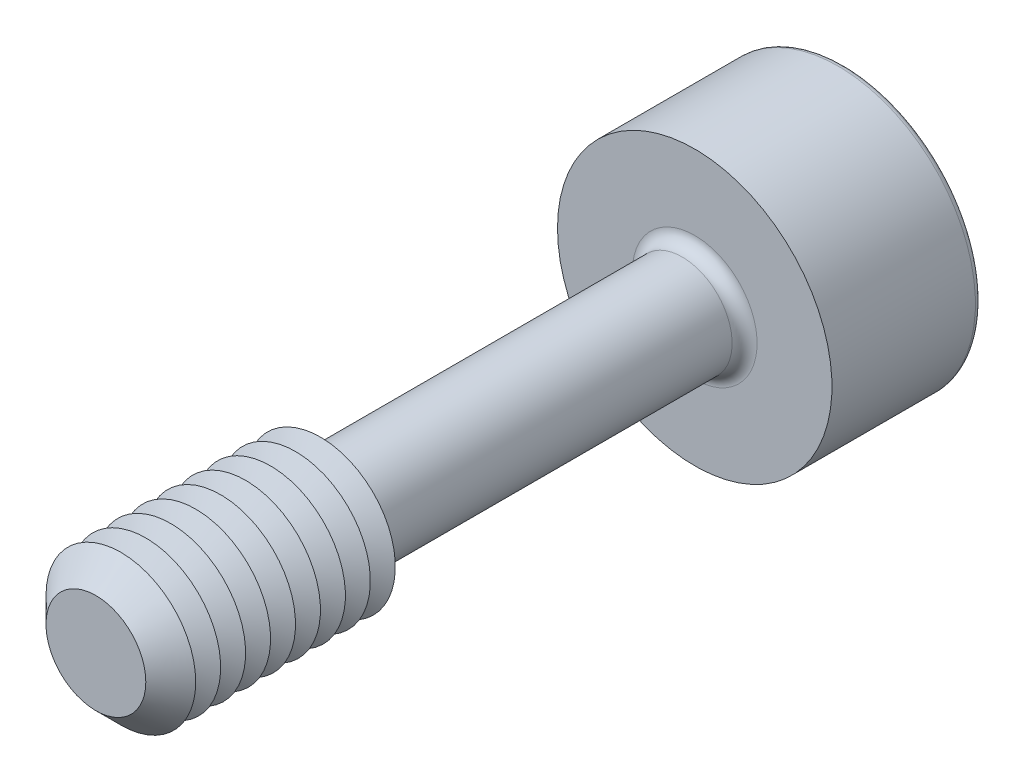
ISO-10303-21;
HEADER;
FILE_DESCRIPTION(('STEP AP214'),'2;1');
FILE_NAME('part.step','',(''),(''),'','','');
FILE_SCHEMA(('AUTOMOTIVE_DESIGN { 1 0 10303 214 1 1 1 1 }'));
ENDSEC;
DATA;
#1=APPLICATION_CONTEXT('core data for automotive mechanical design processes');
#2=APPLICATION_PROTOCOL_DEFINITION('international standard','automotive_design',2000,#1);
#3=PRODUCT_CONTEXT('',#1,'mechanical');
#4=PRODUCT('Part','Part','',(#3));
#5=PRODUCT_RELATED_PRODUCT_CATEGORY('part','',(#4));
#6=PRODUCT_DEFINITION_FORMATION('','',#4);
#7=PRODUCT_DEFINITION_CONTEXT('part definition',#1,'design');
#8=PRODUCT_DEFINITION('design','',#6,#7);
#9=PRODUCT_DEFINITION_SHAPE('','',#8);
#10=(LENGTH_UNIT() NAMED_UNIT(*) SI_UNIT(.MILLI.,.METRE.));
#11=(NAMED_UNIT(*) PLANE_ANGLE_UNIT() SI_UNIT($,.RADIAN.));
#12=(NAMED_UNIT(*) SI_UNIT($,.STERADIAN.) SOLID_ANGLE_UNIT());
#13=UNCERTAINTY_MEASURE_WITH_UNIT(LENGTH_MEASURE(1.E-05),#10,'distance_accuracy_value','');
#14=(GEOMETRIC_REPRESENTATION_CONTEXT(3) GLOBAL_UNCERTAINTY_ASSIGNED_CONTEXT((#13)) GLOBAL_UNIT_ASSIGNED_CONTEXT((#10,
#11,#12)) REPRESENTATION_CONTEXT('',''));
#15=CARTESIAN_POINT('',(0.,0.,0.));
#16=DIRECTION('',(0.,0.,1.));
#17=DIRECTION('',(1.,0.,0.));
#18=AXIS2_PLACEMENT_3D('',#15,#16,#17);
#19=CARTESIAN_POINT('',(-0.721687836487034,-1.25,-6.5));
#20=DIRECTION('',(0.,0.,1.));
#21=DIRECTION('',(1.,0.,0.));
#22=AXIS2_PLACEMENT_3D('',#19,#20,#21);
#23=PLANE('',#22);
#24=DIRECTION('',(1.,0.,0.));
#25=VECTOR('',#24,1.);
#26=CARTESIAN_POINT('',(-0.721687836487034,-1.25,-6.5));
#27=LINE('',#26,#25);
#28=CARTESIAN_POINT('',(0.,-1.25,-6.5));
#29=VERTEX_POINT('',#28);
#30=CARTESIAN_POINT('',(0.721687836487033,-1.25,-6.5));
#31=VERTEX_POINT('',#30);
#32=EDGE_CURVE('E413',#29,#31,#27,.T.);
#33=ORIENTED_EDGE('',*,*,#32,.F.);
#34=CARTESIAN_POINT('',(0.,0.,-6.5));
#35=DIRECTION('',(0.,0.,1.));
#36=DIRECTION('',(0.,-1.,0.));
#37=AXIS2_PLACEMENT_3D('',#34,#35,#36);
#38=CIRCLE('',#37,1.25);
#39=CARTESIAN_POINT('',(1.08253175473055,-0.624999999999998,-6.5));
#40=VERTEX_POINT('',#39);
#41=EDGE_CURVE('E53',#29,#40,#38,.T.);
#42=ORIENTED_EDGE('',*,*,#41,.T.);
#43=DIRECTION('',(0.499999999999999,0.866025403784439,0.));
#44=VECTOR('',#43,1.);
#45=CARTESIAN_POINT('',(0.721687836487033,-1.25,-6.5));
#46=LINE('',#45,#44);
#47=EDGE_CURVE('E403',#31,#40,#46,.T.);
#48=ORIENTED_EDGE('',*,*,#47,.F.);
#49=EDGE_LOOP('',(#33,#42,#48));
#50=FACE_BOUND('',#49,.T.);
#51=ADVANCED_FACE('F41',(#50),#23,.F.);
#52=CARTESIAN_POINT('',(1.44337567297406,0.,-6.5));
#53=VERTEX_POINT('',#52);
#54=EDGE_CURVE('E407',#40,#53,#46,.T.);
#55=ORIENTED_EDGE('',*,*,#54,.F.);
#56=CARTESIAN_POINT('',(1.08253175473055,0.625000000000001,-6.5));
#57=VERTEX_POINT('',#56);
#58=EDGE_CURVE('E11',#40,#57,#38,.T.);
#59=ORIENTED_EDGE('',*,*,#58,.T.);
#60=DIRECTION('',(-0.499999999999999,0.866025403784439,0.));
#61=VECTOR('',#60,1.);
#62=CARTESIAN_POINT('',(1.44337567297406,0.,-6.5));
#63=LINE('',#62,#61);
#64=EDGE_CURVE('E399',#53,#57,#63,.T.);
#65=ORIENTED_EDGE('',*,*,#64,.F.);
#66=EDGE_LOOP('',(#55,#59,#65));
#67=FACE_BOUND('',#66,.T.);
#68=ADVANCED_FACE('F133',(#67),#23,.F.);
#69=CARTESIAN_POINT('',(0.721687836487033,1.25,-6.5));
#70=VERTEX_POINT('',#69);
#71=EDGE_CURVE('E398',#57,#70,#63,.T.);
#72=ORIENTED_EDGE('',*,*,#71,.F.);
#73=CARTESIAN_POINT('',(0.,1.25,-6.5));
#74=VERTEX_POINT('',#73);
#75=EDGE_CURVE('E51',#57,#74,#38,.T.);
#76=ORIENTED_EDGE('',*,*,#75,.T.);
#77=DIRECTION('',(-1.,0.,0.));
#78=VECTOR('',#77,1.);
#79=CARTESIAN_POINT('',(0.721687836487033,1.25,-6.5));
#80=LINE('',#79,#78);
#81=EDGE_CURVE('E177',#70,#74,#80,.T.);
#82=ORIENTED_EDGE('',*,*,#81,.F.);
#83=EDGE_LOOP('',(#72,#76,#82));
#84=FACE_BOUND('',#83,.T.);
#85=ADVANCED_FACE('F139',(#84),#23,.F.);
#86=CARTESIAN_POINT('',(-0.721687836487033,1.25,-6.5));
#87=VERTEX_POINT('',#86);
#88=EDGE_CURVE('E405',#74,#87,#80,.T.);
#89=ORIENTED_EDGE('',*,*,#88,.F.);
#90=CARTESIAN_POINT('',(-1.08253175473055,0.625000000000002,-6.5));
#91=VERTEX_POINT('',#90);
#92=EDGE_CURVE('E264',#74,#91,#38,.T.);
#93=ORIENTED_EDGE('',*,*,#92,.T.);
#94=DIRECTION('',(-0.5,-0.866025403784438,0.));
#95=VECTOR('',#94,1.);
#96=CARTESIAN_POINT('',(-0.721687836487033,1.25,-6.5));
#97=LINE('',#96,#95);
#98=EDGE_CURVE('E176',#87,#91,#97,.T.);
#99=ORIENTED_EDGE('',*,*,#98,.F.);
#100=EDGE_LOOP('',(#89,#93,#99));
#101=FACE_BOUND('',#100,.T.);
#102=ADVANCED_FACE('F157',(#101),#23,.F.);
#103=CARTESIAN_POINT('',(-1.44337567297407,0.,-6.5));
#104=VERTEX_POINT('',#103);
#105=EDGE_CURVE('E170',#91,#104,#97,.T.);
#106=ORIENTED_EDGE('',*,*,#105,.F.);
#107=CARTESIAN_POINT('',(-1.08253175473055,-0.624999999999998,-6.5));
#108=VERTEX_POINT('',#107);
#109=EDGE_CURVE('E172',#91,#108,#38,.T.);
#110=ORIENTED_EDGE('',*,*,#109,.T.);
#111=DIRECTION('',(0.5,-0.866025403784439,0.));
#112=VECTOR('',#111,1.);
#113=CARTESIAN_POINT('',(-1.44337567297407,0.,-6.5));
#114=LINE('',#113,#112);
#115=EDGE_CURVE('E174',#104,#108,#114,.T.);
#116=ORIENTED_EDGE('',*,*,#115,.F.);
#117=EDGE_LOOP('',(#106,#110,#116));
#118=FACE_BOUND('',#117,.T.);
#119=ADVANCED_FACE('F146',(#118),#23,.F.);
#120=CARTESIAN_POINT('',(0.,0.,-9.));
#121=DIRECTION('',(0.,0.,-1.));
#122=DIRECTION('',(-1.,0.,0.));
#123=AXIS2_PLACEMENT_3D('',#120,#121,#122);
#124=PLANE('',#123);
#125=CARTESIAN_POINT('',(0.,0.,-9.));
#126=DIRECTION('',(0.,0.,-1.));
#127=DIRECTION('',(-1.,0.,0.));
#128=AXIS2_PLACEMENT_3D('',#125,#126,#127);
#129=CIRCLE('',#128,2.625);
#130=CARTESIAN_POINT('',(-2.625,0.,-9.));
#131=VERTEX_POINT('',#130);
#132=EDGE_CURVE('E250',#131,#131,#129,.T.);
#133=ORIENTED_EDGE('',*,*,#132,.T.);
#134=EDGE_LOOP('',(#133));
#135=FACE_BOUND('',#134,.T.);
#136=DIRECTION('',(-0.5,-0.866025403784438,0.));
#137=VECTOR('',#136,1.);
#138=CARTESIAN_POINT('',(-0.721687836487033,1.25,-9.));
#139=LINE('',#138,#137);
#140=CARTESIAN_POINT('',(-0.721687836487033,1.25,-9.));
#141=VERTEX_POINT('',#140);
#142=CARTESIAN_POINT('',(-1.44337567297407,0.,-9.));
#143=VERTEX_POINT('',#142);
#144=EDGE_CURVE('E212',#141,#143,#139,.T.);
#145=ORIENTED_EDGE('',*,*,#144,.T.);
#146=DIRECTION('',(0.5,-0.866025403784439,0.));
#147=VECTOR('',#146,1.);
#148=CARTESIAN_POINT('',(-1.44337567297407,0.,-9.));
#149=LINE('',#148,#147);
#150=CARTESIAN_POINT('',(-0.721687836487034,-1.25,-9.));
#151=VERTEX_POINT('',#150);
#152=EDGE_CURVE('E67',#143,#151,#149,.T.);
#153=ORIENTED_EDGE('',*,*,#152,.T.);
#154=DIRECTION('',(1.,0.,0.));
#155=VECTOR('',#154,1.);
#156=CARTESIAN_POINT('',(-0.721687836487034,-1.25,-9.));
#157=LINE('',#156,#155);
#158=CARTESIAN_POINT('',(0.721687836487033,-1.25,-9.));
#159=VERTEX_POINT('',#158);
#160=EDGE_CURVE('E196',#151,#159,#157,.T.);
#161=ORIENTED_EDGE('',*,*,#160,.T.);
#162=DIRECTION('',(0.499999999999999,0.866025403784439,0.));
#163=VECTOR('',#162,1.);
#164=CARTESIAN_POINT('',(0.721687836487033,-1.25,-9.));
#165=LINE('',#164,#163);
#166=CARTESIAN_POINT('',(1.44337567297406,0.,-9.));
#167=VERTEX_POINT('',#166);
#168=EDGE_CURVE('E200',#159,#167,#165,.T.);
#169=ORIENTED_EDGE('',*,*,#168,.T.);
#170=DIRECTION('',(-0.499999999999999,0.866025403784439,0.));
#171=VECTOR('',#170,1.);
#172=CARTESIAN_POINT('',(1.44337567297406,0.,-9.));
#173=LINE('',#172,#171);
#174=CARTESIAN_POINT('',(0.721687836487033,1.25,-9.));
#175=VERTEX_POINT('',#174);
#176=EDGE_CURVE('E204',#167,#175,#173,.T.);
#177=ORIENTED_EDGE('',*,*,#176,.T.);
#178=DIRECTION('',(-1.,0.,0.));
#179=VECTOR('',#178,1.);
#180=CARTESIAN_POINT('',(0.721687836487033,1.25,-9.));
#181=LINE('',#180,#179);
#182=EDGE_CURVE('E208',#175,#141,#181,.T.);
#183=ORIENTED_EDGE('',*,*,#182,.T.);
#184=EDGE_LOOP('',(#145,#153,#161,#169,#177,#183));
#185=FACE_BOUND('',#184,.T.);
#186=ADVANCED_FACE('F156',(#135,#185),#124,.T.);
#187=CARTESIAN_POINT('',(0.,0.,6.));
#188=DIRECTION('',(0.,0.,-1.));
#189=DIRECTION('',(-1.,0.,0.));
#190=AXIS2_PLACEMENT_3D('',#187,#188,#189);
#191=CYLINDRICAL_SURFACE('',#190,1.);
#192=CARTESIAN_POINT('',(0.,0.,-5.75));
#193=DIRECTION('',(0.,0.,-1.));
#194=DIRECTION('',(-1.,0.,0.));
#195=AXIS2_PLACEMENT_3D('',#192,#193,#194);
#196=CIRCLE('',#195,1.);
#197=CARTESIAN_POINT('',(-1.,0.,-5.75));
#198=VERTEX_POINT('',#197);
#199=EDGE_CURVE('E247',#198,#198,#196,.F.);
#200=ORIENTED_EDGE('',*,*,#199,.T.);
#201=EDGE_LOOP('',(#200));
#202=FACE_BOUND('',#201,.T.);
#203=CARTESIAN_POINT('',(0.,0.,1.21132486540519));
#204=DIRECTION('',(0.,0.,-1.));
#205=DIRECTION('',(0.,1.,0.));
#206=AXIS2_PLACEMENT_3D('',#203,#204,#205);
#207=CIRCLE('',#206,1.);
#208=CARTESIAN_POINT('',(0.,1.,1.21132486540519));
#209=VERTEX_POINT('',#208);
#210=EDGE_CURVE('E235',#209,#209,#207,.T.);
#211=ORIENTED_EDGE('',*,*,#210,.T.);
#212=EDGE_LOOP('',(#211));
#213=FACE_BOUND('',#212,.T.);
#214=ADVANCED_FACE('F163',(#202,#213),#191,.T.);
#215=CARTESIAN_POINT('',(0.,0.,1.21132486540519));
#216=DIRECTION('',(0.,0.,1.));
#217=DIRECTION('',(0.,-1.,0.));
#218=AXIS2_PLACEMENT_3D('',#215,#216,#217);
#219=CONICAL_SURFACE('',#218,1.,1.0471975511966);
#220=CARTESIAN_POINT('',(0.,0.,1.5));
#221=DIRECTION('',(0.,0.,-1.));
#222=DIRECTION('',(-1.,0.,0.));
#223=AXIS2_PLACEMENT_3D('',#220,#221,#222);
#224=CIRCLE('',#223,1.5);
#225=CARTESIAN_POINT('',(-1.5,0.,1.5));
#226=VERTEX_POINT('',#225);
#227=EDGE_CURVE('E268',#226,#226,#224,.T.);
#228=ORIENTED_EDGE('',*,*,#227,.T.);
#229=EDGE_LOOP('',(#228));
#230=FACE_BOUND('',#229,.T.);
#231=ORIENTED_EDGE('',*,*,#210,.F.);
#232=EDGE_LOOP('',(#231));
#233=FACE_BOUND('',#232,.T.);
#234=ADVANCED_FACE('F356',(#230,#233),#219,.T.);
#235=CARTESIAN_POINT('',(0.,0.,-6.));
#236=DIRECTION('',(0.,0.,-1.));
#237=DIRECTION('',(-1.,0.,0.));
#238=AXIS2_PLACEMENT_3D('',#235,#236,#237);
#239=PLANE('',#238);
#240=CARTESIAN_POINT('',(0.,0.,-6.));
#241=DIRECTION('',(0.,0.,-1.));
#242=DIRECTION('',(-1.,0.,0.));
#243=AXIS2_PLACEMENT_3D('',#240,#241,#242);
#244=CIRCLE('',#243,1.25);
#245=CARTESIAN_POINT('',(-1.25,0.,-6.));
#246=VERTEX_POINT('',#245);
#247=EDGE_CURVE('E243',#246,#246,#244,.T.);
#248=ORIENTED_EDGE('',*,*,#247,.T.);
#249=EDGE_LOOP('',(#248));
#250=FACE_BOUND('',#249,.T.);
#251=CARTESIAN_POINT('',(0.,0.,-6.));
#252=DIRECTION('',(0.,0.,-1.));
#253=DIRECTION('',(-1.,0.,0.));
#254=AXIS2_PLACEMENT_3D('',#251,#252,#253);
#255=CIRCLE('',#254,2.75);
#256=CARTESIAN_POINT('',(-2.75,0.,-6.));
#257=VERTEX_POINT('',#256);
#258=EDGE_CURVE('E231',#257,#257,#255,.T.);
#259=ORIENTED_EDGE('',*,*,#258,.F.);
#260=EDGE_LOOP('',(#259));
#261=FACE_BOUND('',#260,.T.);
#262=ADVANCED_FACE('F361',(#250,#261),#239,.F.);
#263=CARTESIAN_POINT('',(0.,0.,-9.));
#264=DIRECTION('',(0.,0.,1.));
#265=DIRECTION('',(1.,0.,0.));
#266=AXIS2_PLACEMENT_3D('',#263,#264,#265);
#267=CYLINDRICAL_SURFACE('',#266,2.75);
#268=CARTESIAN_POINT('',(0.,0.,-8.875));
#269=DIRECTION('',(0.,0.,-1.));
#270=DIRECTION('',(-1.,0.,0.));
#271=AXIS2_PLACEMENT_3D('',#268,#269,#270);
#272=CIRCLE('',#271,2.75);
#273=CARTESIAN_POINT('',(-2.75,0.,-8.875));
#274=VERTEX_POINT('',#273);
#275=EDGE_CURVE('E45',#274,#274,#272,.F.);
#276=ORIENTED_EDGE('',*,*,#275,.T.);
#277=EDGE_LOOP('',(#276));
#278=FACE_BOUND('',#277,.T.);
#279=ORIENTED_EDGE('',*,*,#258,.T.);
#280=EDGE_LOOP('',(#279));
#281=FACE_BOUND('',#280,.T.);
#282=ADVANCED_FACE('F362',(#278,#281),#267,.T.);
#283=CARTESIAN_POINT('',(-1.44337567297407,0.,-6.5));
#284=DIRECTION('',(0.866025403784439,0.5,0.));
#285=DIRECTION('',(-0.5,0.866025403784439,0.));
#286=AXIS2_PLACEMENT_3D('',#283,#284,#285);
#287=PLANE('',#286);
#288=ORIENTED_EDGE('',*,*,#152,.F.);
#289=DIRECTION('',(0.,0.,-1.));
#290=VECTOR('',#289,1.);
#291=CARTESIAN_POINT('',(-1.44337567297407,0.,-6.5));
#292=LINE('',#291,#290);
#293=EDGE_CURVE('E186',#104,#143,#292,.T.);
#294=ORIENTED_EDGE('',*,*,#293,.F.);
#295=ORIENTED_EDGE('',*,*,#115,.T.);
#296=CARTESIAN_POINT('',(-0.721687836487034,-1.25,-6.5));
#297=VERTEX_POINT('',#296);
#298=EDGE_CURVE('E215',#108,#297,#114,.T.);
#299=ORIENTED_EDGE('',*,*,#298,.T.);
#300=DIRECTION('',(0.,0.,-1.));
#301=VECTOR('',#300,1.);
#302=CARTESIAN_POINT('',(-0.721687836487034,-1.25,-6.5));
#303=LINE('',#302,#301);
#304=EDGE_CURVE('E228',#297,#151,#303,.T.);
#305=ORIENTED_EDGE('',*,*,#304,.T.);
#306=EDGE_LOOP('',(#288,#294,#295,#299,#305));
#307=FACE_BOUND('',#306,.T.);
#308=ADVANCED_FACE('F365',(#307),#287,.T.);
#309=CARTESIAN_POINT('',(-0.721687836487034,-1.25,-6.5));
#310=DIRECTION('',(0.,1.,0.));
#311=DIRECTION('',(0.,0.,1.));
#312=AXIS2_PLACEMENT_3D('',#309,#310,#311);
#313=PLANE('',#312);
#314=ORIENTED_EDGE('',*,*,#160,.F.);
#315=ORIENTED_EDGE('',*,*,#304,.F.);
#316=EDGE_CURVE('E410',#297,#29,#27,.T.);
#317=ORIENTED_EDGE('',*,*,#316,.T.);
#318=ORIENTED_EDGE('',*,*,#32,.T.);
#319=DIRECTION('',(0.,0.,-1.));
#320=VECTOR('',#319,1.);
#321=CARTESIAN_POINT('',(0.721687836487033,-1.25,-6.5));
#322=LINE('',#321,#320);
#323=EDGE_CURVE('E225',#31,#159,#322,.T.);
#324=ORIENTED_EDGE('',*,*,#323,.T.);
#325=EDGE_LOOP('',(#314,#315,#317,#318,#324));
#326=FACE_BOUND('',#325,.T.);
#327=ADVANCED_FACE('F371',(#326),#313,.T.);
#328=CARTESIAN_POINT('',(0.721687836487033,-1.25,-6.5));
#329=DIRECTION('',(-0.866025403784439,0.499999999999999,0.));
#330=DIRECTION('',(-0.499999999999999,-0.866025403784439,0.));
#331=AXIS2_PLACEMENT_3D('',#328,#329,#330);
#332=PLANE('',#331);
#333=ORIENTED_EDGE('',*,*,#168,.F.);
#334=ORIENTED_EDGE('',*,*,#323,.F.);
#335=ORIENTED_EDGE('',*,*,#47,.T.);
#336=ORIENTED_EDGE('',*,*,#54,.T.);
#337=DIRECTION('',(0.,0.,-1.));
#338=VECTOR('',#337,1.);
#339=CARTESIAN_POINT('',(1.44337567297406,0.,-6.5));
#340=LINE('',#339,#338);
#341=EDGE_CURVE('E222',#53,#167,#340,.T.);
#342=ORIENTED_EDGE('',*,*,#341,.T.);
#343=EDGE_LOOP('',(#333,#334,#335,#336,#342));
#344=FACE_BOUND('',#343,.T.);
#345=ADVANCED_FACE('F374',(#344),#332,.T.);
#346=CARTESIAN_POINT('',(1.44337567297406,0.,-6.5));
#347=DIRECTION('',(-0.866025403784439,-0.5,0.));
#348=DIRECTION('',(0.5,-0.866025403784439,0.));
#349=AXIS2_PLACEMENT_3D('',#346,#347,#348);
#350=PLANE('',#349);
#351=ORIENTED_EDGE('',*,*,#176,.F.);
#352=ORIENTED_EDGE('',*,*,#341,.F.);
#353=ORIENTED_EDGE('',*,*,#64,.T.);
#354=ORIENTED_EDGE('',*,*,#71,.T.);
#355=DIRECTION('',(0.,0.,-1.));
#356=VECTOR('',#355,1.);
#357=CARTESIAN_POINT('',(0.721687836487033,1.25,-6.5));
#358=LINE('',#357,#356);
#359=EDGE_CURVE('E219',#70,#175,#358,.T.);
#360=ORIENTED_EDGE('',*,*,#359,.T.);
#361=EDGE_LOOP('',(#351,#352,#353,#354,#360));
#362=FACE_BOUND('',#361,.T.);
#363=ADVANCED_FACE('F378',(#362),#350,.T.);
#364=CARTESIAN_POINT('',(0.721687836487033,1.25,-6.5));
#365=DIRECTION('',(0.,-1.,0.));
#366=DIRECTION('',(1.,0.,0.));
#367=AXIS2_PLACEMENT_3D('',#364,#365,#366);
#368=PLANE('',#367);
#369=ORIENTED_EDGE('',*,*,#182,.F.);
#370=ORIENTED_EDGE('',*,*,#359,.F.);
#371=ORIENTED_EDGE('',*,*,#81,.T.);
#372=ORIENTED_EDGE('',*,*,#88,.T.);
#373=DIRECTION('',(0.,0.,-1.));
#374=VECTOR('',#373,1.);
#375=CARTESIAN_POINT('',(-0.721687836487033,1.25,-6.5));
#376=LINE('',#375,#374);
#377=EDGE_CURVE('E182',#87,#141,#376,.T.);
#378=ORIENTED_EDGE('',*,*,#377,.T.);
#379=EDGE_LOOP('',(#369,#370,#371,#372,#378));
#380=FACE_BOUND('',#379,.T.);
#381=ADVANCED_FACE('F152',(#380),#368,.T.);
#382=CARTESIAN_POINT('',(-0.721687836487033,1.25,-6.5));
#383=DIRECTION('',(0.866025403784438,-0.5,0.));
#384=DIRECTION('',(0.5,0.866025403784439,0.));
#385=AXIS2_PLACEMENT_3D('',#382,#383,#384);
#386=PLANE('',#385);
#387=ORIENTED_EDGE('',*,*,#144,.F.);
#388=ORIENTED_EDGE('',*,*,#377,.F.);
#389=ORIENTED_EDGE('',*,*,#98,.T.);
#390=ORIENTED_EDGE('',*,*,#105,.T.);
#391=ORIENTED_EDGE('',*,*,#293,.T.);
#392=EDGE_LOOP('',(#387,#388,#389,#390,#391));
#393=FACE_BOUND('',#392,.T.);
#394=ADVANCED_FACE('F144',(#393),#386,.T.);
#395=ORIENTED_EDGE('',*,*,#298,.F.);
#396=EDGE_CURVE('E257',#108,#29,#38,.T.);
#397=ORIENTED_EDGE('',*,*,#396,.T.);
#398=ORIENTED_EDGE('',*,*,#316,.F.);
#399=EDGE_LOOP('',(#395,#397,#398));
#400=FACE_BOUND('',#399,.T.);
#401=ADVANCED_FACE('F135',(#400),#23,.F.);
#402=CARTESIAN_POINT('',(0.,0.,-5.75));
#403=DIRECTION('',(0.,0.,-1.));
#404=DIRECTION('',(-1.,0.,0.));
#405=AXIS2_PLACEMENT_3D('',#402,#403,#404);
#406=TOROIDAL_SURFACE('',#405,1.25,0.25);
#407=ORIENTED_EDGE('',*,*,#199,.F.);
#408=EDGE_LOOP('',(#407));
#409=FACE_BOUND('',#408,.T.);
#410=ORIENTED_EDGE('',*,*,#247,.F.);
#411=EDGE_LOOP('',(#410));
#412=FACE_BOUND('',#411,.T.);
#413=ADVANCED_FACE('F129',(#409,#412),#406,.F.);
#414=CARTESIAN_POINT('',(0.,0.,-8.875));
#415=DIRECTION('',(0.,0.,-1.));
#416=DIRECTION('',(-1.,0.,0.));
#417=AXIS2_PLACEMENT_3D('',#414,#415,#416);
#418=TOROIDAL_SURFACE('',#417,2.625,0.125);
#419=ORIENTED_EDGE('',*,*,#275,.F.);
#420=EDGE_LOOP('',(#419));
#421=FACE_BOUND('',#420,.T.);
#422=ORIENTED_EDGE('',*,*,#132,.F.);
#423=EDGE_LOOP('',(#422));
#424=FACE_BOUND('',#423,.T.);
#425=ADVANCED_FACE('F43',(#421,#424),#418,.T.);
#426=CARTESIAN_POINT('',(0.,0.,-5.77831216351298));
#427=DIRECTION('',(0.,0.,-1.));
#428=DIRECTION('',(0.,1.,0.));
#429=AXIS2_PLACEMENT_3D('',#426,#427,#428);
#430=CONICAL_SURFACE('',#429,0.,1.0471975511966);
#431=ORIENTED_EDGE('',*,*,#41,.F.);
#432=ORIENTED_EDGE('',*,*,#396,.F.);
#433=ORIENTED_EDGE('',*,*,#109,.F.);
#434=ORIENTED_EDGE('',*,*,#92,.F.);
#435=ORIENTED_EDGE('',*,*,#75,.F.);
#436=ORIENTED_EDGE('',*,*,#58,.F.);
#437=EDGE_LOOP('',(#431,#432,#433,#434,#435,#436));
#438=FACE_BOUND('',#437,.T.);
#439=CARTESIAN_POINT('',(0.,0.,-5.77831216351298));
#440=VERTEX_POINT('',#439);
#441=VERTEX_LOOP('',#440);
#442=FACE_BOUND('',#441,.T.);
#443=ADVANCED_FACE('F118',(#438,#442),#430,.F.);
#444=CARTESIAN_POINT('',(0.,0.,1.75));
#445=DIRECTION('',(0.,0.,-1.));
#446=DIRECTION('',(-1.,0.,0.));
#447=AXIS2_PLACEMENT_3D('',#444,#445,#446);
#448=CONICAL_SURFACE('',#447,1.06698729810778,1.0471975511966);
#449=ORIENTED_EDGE('',*,*,#227,.F.);
#450=EDGE_LOOP('',(#449));
#451=FACE_BOUND('',#450,.T.);
#452=CARTESIAN_POINT('',(0.,0.,1.75));
#453=DIRECTION('',(0.,0.,-1.));
#454=DIRECTION('',(-1.,0.,0.));
#455=AXIS2_PLACEMENT_3D('',#452,#453,#454);
#456=CIRCLE('',#455,1.06698729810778);
#457=CARTESIAN_POINT('',(-1.06698729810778,0.,1.75));
#458=VERTEX_POINT('',#457);
#459=EDGE_CURVE('E274',#458,#458,#456,.T.);
#460=ORIENTED_EDGE('',*,*,#459,.T.);
#461=EDGE_LOOP('',(#460));
#462=FACE_BOUND('',#461,.T.);
#463=ADVANCED_FACE('F120',(#451,#462),#448,.T.);
#464=CARTESIAN_POINT('',(0.,0.,2.));
#465=DIRECTION('',(0.,0.,1.));
#466=DIRECTION('',(1.,0.,0.));
#467=AXIS2_PLACEMENT_3D('',#464,#465,#466);
#468=CONICAL_SURFACE('',#467,1.5,1.0471975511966);
#469=ORIENTED_EDGE('',*,*,#459,.F.);
#470=EDGE_LOOP('',(#469));
#471=FACE_BOUND('',#470,.T.);
#472=CARTESIAN_POINT('',(0.,0.,2.));
#473=DIRECTION('',(0.,0.,-1.));
#474=DIRECTION('',(-1.,0.,0.));
#475=AXIS2_PLACEMENT_3D('',#472,#473,#474);
#476=CIRCLE('',#475,1.5);
#477=CARTESIAN_POINT('',(-1.5,0.,2.));
#478=VERTEX_POINT('',#477);
#479=EDGE_CURVE('E279',#478,#478,#476,.T.);
#480=ORIENTED_EDGE('',*,*,#479,.T.);
#481=EDGE_LOOP('',(#480));
#482=FACE_BOUND('',#481,.T.);
#483=ADVANCED_FACE('F126',(#471,#482),#468,.T.);
#484=CARTESIAN_POINT('',(0.,0.,2.25));
#485=DIRECTION('',(0.,0.,-1.));
#486=DIRECTION('',(-1.,0.,0.));
#487=AXIS2_PLACEMENT_3D('',#484,#485,#486);
#488=CONICAL_SURFACE('',#487,1.06698729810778,1.0471975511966);
#489=ORIENTED_EDGE('',*,*,#479,.F.);
#490=EDGE_LOOP('',(#489));
#491=FACE_BOUND('',#490,.T.);
#492=CARTESIAN_POINT('',(0.,0.,2.25));
#493=DIRECTION('',(0.,0.,-1.));
#494=DIRECTION('',(-1.,0.,0.));
#495=AXIS2_PLACEMENT_3D('',#492,#493,#494);
#496=CIRCLE('',#495,1.06698729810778);
#497=CARTESIAN_POINT('',(-1.06698729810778,0.,2.25));
#498=VERTEX_POINT('',#497);
#499=EDGE_CURVE('E284',#498,#498,#496,.T.);
#500=ORIENTED_EDGE('',*,*,#499,.T.);
#501=EDGE_LOOP('',(#500));
#502=FACE_BOUND('',#501,.T.);
#503=ADVANCED_FACE('F516',(#491,#502),#488,.T.);
#504=CARTESIAN_POINT('',(0.,0.,2.5));
#505=DIRECTION('',(0.,0.,1.));
#506=DIRECTION('',(1.,0.,0.));
#507=AXIS2_PLACEMENT_3D('',#504,#505,#506);
#508=CONICAL_SURFACE('',#507,1.5,1.0471975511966);
#509=ORIENTED_EDGE('',*,*,#499,.F.);
#510=EDGE_LOOP('',(#509));
#511=FACE_BOUND('',#510,.T.);
#512=CARTESIAN_POINT('',(0.,0.,2.5));
#513=DIRECTION('',(0.,0.,-1.));
#514=DIRECTION('',(-1.,0.,0.));
#515=AXIS2_PLACEMENT_3D('',#512,#513,#514);
#516=CIRCLE('',#515,1.5);
#517=CARTESIAN_POINT('',(-1.5,0.,2.5));
#518=VERTEX_POINT('',#517);
#519=EDGE_CURVE('E288',#518,#518,#516,.T.);
#520=ORIENTED_EDGE('',*,*,#519,.T.);
#521=EDGE_LOOP('',(#520));
#522=FACE_BOUND('',#521,.T.);
#523=ADVANCED_FACE('F525',(#511,#522),#508,.T.);
#524=CARTESIAN_POINT('',(0.,0.,2.75));
#525=DIRECTION('',(0.,0.,-1.));
#526=DIRECTION('',(-1.,0.,0.));
#527=AXIS2_PLACEMENT_3D('',#524,#525,#526);
#528=CONICAL_SURFACE('',#527,1.06698729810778,1.0471975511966);
#529=ORIENTED_EDGE('',*,*,#519,.F.);
#530=EDGE_LOOP('',(#529));
#531=FACE_BOUND('',#530,.T.);
#532=CARTESIAN_POINT('',(0.,0.,2.75));
#533=DIRECTION('',(0.,0.,-1.));
#534=DIRECTION('',(-1.,0.,0.));
#535=AXIS2_PLACEMENT_3D('',#532,#533,#534);
#536=CIRCLE('',#535,1.06698729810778);
#537=CARTESIAN_POINT('',(-1.06698729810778,0.,2.75));
#538=VERTEX_POINT('',#537);
#539=EDGE_CURVE('E292',#538,#538,#536,.T.);
#540=ORIENTED_EDGE('',*,*,#539,.T.);
#541=EDGE_LOOP('',(#540));
#542=FACE_BOUND('',#541,.T.);
#543=ADVANCED_FACE('F534',(#531,#542),#528,.T.);
#544=CARTESIAN_POINT('',(0.,0.,3.));
#545=DIRECTION('',(0.,0.,1.));
#546=DIRECTION('',(1.,0.,0.));
#547=AXIS2_PLACEMENT_3D('',#544,#545,#546);
#548=CONICAL_SURFACE('',#547,1.5,1.0471975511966);
#549=ORIENTED_EDGE('',*,*,#539,.F.);
#550=EDGE_LOOP('',(#549));
#551=FACE_BOUND('',#550,.T.);
#552=CARTESIAN_POINT('',(0.,0.,3.));
#553=DIRECTION('',(0.,0.,-1.));
#554=DIRECTION('',(-1.,0.,0.));
#555=AXIS2_PLACEMENT_3D('',#552,#553,#554);
#556=CIRCLE('',#555,1.5);
#557=CARTESIAN_POINT('',(-1.5,0.,3.));
#558=VERTEX_POINT('',#557);
#559=EDGE_CURVE('E296',#558,#558,#556,.T.);
#560=ORIENTED_EDGE('',*,*,#559,.T.);
#561=EDGE_LOOP('',(#560));
#562=FACE_BOUND('',#561,.T.);
#563=ADVANCED_FACE('F543',(#551,#562),#548,.T.);
#564=CARTESIAN_POINT('',(0.,0.,3.25));
#565=DIRECTION('',(0.,0.,-1.));
#566=DIRECTION('',(-1.,0.,0.));
#567=AXIS2_PLACEMENT_3D('',#564,#565,#566);
#568=CONICAL_SURFACE('',#567,1.06698729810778,1.0471975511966);
#569=ORIENTED_EDGE('',*,*,#559,.F.);
#570=EDGE_LOOP('',(#569));
#571=FACE_BOUND('',#570,.T.);
#572=CARTESIAN_POINT('',(0.,0.,3.25));
#573=DIRECTION('',(0.,0.,-1.));
#574=DIRECTION('',(-1.,0.,0.));
#575=AXIS2_PLACEMENT_3D('',#572,#573,#574);
#576=CIRCLE('',#575,1.06698729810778);
#577=CARTESIAN_POINT('',(-1.06698729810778,0.,3.25));
#578=VERTEX_POINT('',#577);
#579=EDGE_CURVE('E300',#578,#578,#576,.T.);
#580=ORIENTED_EDGE('',*,*,#579,.T.);
#581=EDGE_LOOP('',(#580));
#582=FACE_BOUND('',#581,.T.);
#583=ADVANCED_FACE('F552',(#571,#582),#568,.T.);
#584=CARTESIAN_POINT('',(0.,0.,3.5));
#585=DIRECTION('',(0.,0.,1.));
#586=DIRECTION('',(1.,0.,0.));
#587=AXIS2_PLACEMENT_3D('',#584,#585,#586);
#588=CONICAL_SURFACE('',#587,1.5,1.0471975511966);
#589=ORIENTED_EDGE('',*,*,#579,.F.);
#590=EDGE_LOOP('',(#589));
#591=FACE_BOUND('',#590,.T.);
#592=CARTESIAN_POINT('',(0.,0.,3.5));
#593=DIRECTION('',(0.,0.,-1.));
#594=DIRECTION('',(-1.,0.,0.));
#595=AXIS2_PLACEMENT_3D('',#592,#593,#594);
#596=CIRCLE('',#595,1.5);
#597=CARTESIAN_POINT('',(-1.5,0.,3.5));
#598=VERTEX_POINT('',#597);
#599=EDGE_CURVE('E304',#598,#598,#596,.T.);
#600=ORIENTED_EDGE('',*,*,#599,.T.);
#601=EDGE_LOOP('',(#600));
#602=FACE_BOUND('',#601,.T.);
#603=ADVANCED_FACE('F561',(#591,#602),#588,.T.);
#604=CARTESIAN_POINT('',(0.,0.,3.75));
#605=DIRECTION('',(0.,0.,-1.));
#606=DIRECTION('',(-1.,0.,0.));
#607=AXIS2_PLACEMENT_3D('',#604,#605,#606);
#608=CONICAL_SURFACE('',#607,1.06698729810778,1.0471975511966);
#609=ORIENTED_EDGE('',*,*,#599,.F.);
#610=EDGE_LOOP('',(#609));
#611=FACE_BOUND('',#610,.T.);
#612=CARTESIAN_POINT('',(0.,0.,3.75));
#613=DIRECTION('',(0.,0.,-1.));
#614=DIRECTION('',(-1.,0.,0.));
#615=AXIS2_PLACEMENT_3D('',#612,#613,#614);
#616=CIRCLE('',#615,1.06698729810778);
#617=CARTESIAN_POINT('',(-1.06698729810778,0.,3.75));
#618=VERTEX_POINT('',#617);
#619=EDGE_CURVE('E308',#618,#618,#616,.T.);
#620=ORIENTED_EDGE('',*,*,#619,.T.);
#621=EDGE_LOOP('',(#620));
#622=FACE_BOUND('',#621,.T.);
#623=ADVANCED_FACE('F570',(#611,#622),#608,.T.);
#624=CARTESIAN_POINT('',(0.,0.,4.));
#625=DIRECTION('',(0.,0.,1.));
#626=DIRECTION('',(1.,0.,0.));
#627=AXIS2_PLACEMENT_3D('',#624,#625,#626);
#628=CONICAL_SURFACE('',#627,1.5,1.0471975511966);
#629=ORIENTED_EDGE('',*,*,#619,.F.);
#630=EDGE_LOOP('',(#629));
#631=FACE_BOUND('',#630,.T.);
#632=CARTESIAN_POINT('',(0.,0.,4.));
#633=DIRECTION('',(0.,0.,-1.));
#634=DIRECTION('',(-1.,0.,0.));
#635=AXIS2_PLACEMENT_3D('',#632,#633,#634);
#636=CIRCLE('',#635,1.5);
#637=CARTESIAN_POINT('',(-1.5,0.,4.));
#638=VERTEX_POINT('',#637);
#639=EDGE_CURVE('E312',#638,#638,#636,.T.);
#640=ORIENTED_EDGE('',*,*,#639,.T.);
#641=EDGE_LOOP('',(#640));
#642=FACE_BOUND('',#641,.T.);
#643=ADVANCED_FACE('F579',(#631,#642),#628,.T.);
#644=CARTESIAN_POINT('',(0.,0.,4.25));
#645=DIRECTION('',(0.,0.,-1.));
#646=DIRECTION('',(-1.,0.,0.));
#647=AXIS2_PLACEMENT_3D('',#644,#645,#646);
#648=CONICAL_SURFACE('',#647,1.06698729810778,1.0471975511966);
#649=ORIENTED_EDGE('',*,*,#639,.F.);
#650=EDGE_LOOP('',(#649));
#651=FACE_BOUND('',#650,.T.);
#652=CARTESIAN_POINT('',(0.,0.,4.25));
#653=DIRECTION('',(0.,0.,-1.));
#654=DIRECTION('',(-1.,0.,0.));
#655=AXIS2_PLACEMENT_3D('',#652,#653,#654);
#656=CIRCLE('',#655,1.06698729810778);
#657=CARTESIAN_POINT('',(-1.06698729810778,0.,4.25));
#658=VERTEX_POINT('',#657);
#659=EDGE_CURVE('E315',#658,#658,#656,.T.);
#660=ORIENTED_EDGE('',*,*,#659,.T.);
#661=EDGE_LOOP('',(#660));
#662=FACE_BOUND('',#661,.T.);
#663=ADVANCED_FACE('F588',(#651,#662),#648,.T.);
#664=CARTESIAN_POINT('',(0.,0.,4.5));
#665=DIRECTION('',(0.,0.,1.));
#666=DIRECTION('',(1.,0.,0.));
#667=AXIS2_PLACEMENT_3D('',#664,#665,#666);
#668=CONICAL_SURFACE('',#667,1.5,1.0471975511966);
#669=ORIENTED_EDGE('',*,*,#659,.F.);
#670=EDGE_LOOP('',(#669));
#671=FACE_BOUND('',#670,.T.);
#672=CARTESIAN_POINT('',(0.,0.,4.5));
#673=DIRECTION('',(0.,0.,-1.));
#674=DIRECTION('',(-1.,0.,0.));
#675=AXIS2_PLACEMENT_3D('',#672,#673,#674);
#676=CIRCLE('',#675,1.5);
#677=CARTESIAN_POINT('',(-1.5,0.,4.5));
#678=VERTEX_POINT('',#677);
#679=EDGE_CURVE('E319',#678,#678,#676,.T.);
#680=ORIENTED_EDGE('',*,*,#679,.T.);
#681=EDGE_LOOP('',(#680));
#682=FACE_BOUND('',#681,.T.);
#683=ADVANCED_FACE('F597',(#671,#682),#668,.T.);
#684=CARTESIAN_POINT('',(0.,0.,4.75));
#685=DIRECTION('',(0.,0.,-1.));
#686=DIRECTION('',(-1.,0.,0.));
#687=AXIS2_PLACEMENT_3D('',#684,#685,#686);
#688=CONICAL_SURFACE('',#687,1.06698729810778,1.0471975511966);
#689=ORIENTED_EDGE('',*,*,#679,.F.);
#690=EDGE_LOOP('',(#689));
#691=FACE_BOUND('',#690,.T.);
#692=CARTESIAN_POINT('',(0.,0.,4.75));
#693=DIRECTION('',(0.,0.,-1.));
#694=DIRECTION('',(-1.,0.,0.));
#695=AXIS2_PLACEMENT_3D('',#692,#693,#694);
#696=CIRCLE('',#695,1.06698729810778);
#697=CARTESIAN_POINT('',(-1.06698729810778,0.,4.75));
#698=VERTEX_POINT('',#697);
#699=EDGE_CURVE('E323',#698,#698,#696,.T.);
#700=ORIENTED_EDGE('',*,*,#699,.T.);
#701=EDGE_LOOP('',(#700));
#702=FACE_BOUND('',#701,.T.);
#703=ADVANCED_FACE('F606',(#691,#702),#688,.T.);
#704=CARTESIAN_POINT('',(0.,0.,5.));
#705=DIRECTION('',(0.,0.,1.));
#706=DIRECTION('',(1.,0.,0.));
#707=AXIS2_PLACEMENT_3D('',#704,#705,#706);
#708=CONICAL_SURFACE('',#707,1.5,1.0471975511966);
#709=ORIENTED_EDGE('',*,*,#699,.F.);
#710=EDGE_LOOP('',(#709));
#711=FACE_BOUND('',#710,.T.);
#712=CARTESIAN_POINT('',(0.,0.,5.));
#713=DIRECTION('',(0.,0.,-1.));
#714=DIRECTION('',(-1.,0.,0.));
#715=AXIS2_PLACEMENT_3D('',#712,#713,#714);
#716=CIRCLE('',#715,1.5);
#717=CARTESIAN_POINT('',(-1.5,0.,5.));
#718=VERTEX_POINT('',#717);
#719=EDGE_CURVE('E327',#718,#718,#716,.T.);
#720=ORIENTED_EDGE('',*,*,#719,.T.);
#721=EDGE_LOOP('',(#720));
#722=FACE_BOUND('',#721,.T.);
#723=ADVANCED_FACE('F615',(#711,#722),#708,.T.);
#724=CARTESIAN_POINT('',(0.,0.,5.25));
#725=DIRECTION('',(0.,0.,-1.));
#726=DIRECTION('',(-1.,0.,0.));
#727=AXIS2_PLACEMENT_3D('',#724,#725,#726);
#728=CONICAL_SURFACE('',#727,1.06698729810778,1.0471975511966);
#729=ORIENTED_EDGE('',*,*,#719,.F.);
#730=EDGE_LOOP('',(#729));
#731=FACE_BOUND('',#730,.T.);
#732=CARTESIAN_POINT('',(0.,0.,5.25));
#733=DIRECTION('',(0.,0.,-1.));
#734=DIRECTION('',(-1.,0.,0.));
#735=AXIS2_PLACEMENT_3D('',#732,#733,#734);
#736=CIRCLE('',#735,1.06698729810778);
#737=CARTESIAN_POINT('',(-1.06698729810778,0.,5.25));
#738=VERTEX_POINT('',#737);
#739=EDGE_CURVE('E331',#738,#738,#736,.T.);
#740=ORIENTED_EDGE('',*,*,#739,.T.);
#741=EDGE_LOOP('',(#740));
#742=FACE_BOUND('',#741,.T.);
#743=ADVANCED_FACE('F624',(#731,#742),#728,.T.);
#744=CARTESIAN_POINT('',(0.,0.,5.5));
#745=DIRECTION('',(0.,0.,1.));
#746=DIRECTION('',(1.,0.,0.));
#747=AXIS2_PLACEMENT_3D('',#744,#745,#746);
#748=CONICAL_SURFACE('',#747,1.5,1.0471975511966);
#749=ORIENTED_EDGE('',*,*,#739,.F.);
#750=EDGE_LOOP('',(#749));
#751=FACE_BOUND('',#750,.T.);
#752=CARTESIAN_POINT('',(0.,0.,5.5));
#753=DIRECTION('',(0.,0.,-1.));
#754=DIRECTION('',(-1.,0.,0.));
#755=AXIS2_PLACEMENT_3D('',#752,#753,#754);
#756=CIRCLE('',#755,1.5);
#757=CARTESIAN_POINT('',(-1.5,0.,5.5));
#758=VERTEX_POINT('',#757);
#759=EDGE_CURVE('E335',#758,#758,#756,.T.);
#760=ORIENTED_EDGE('',*,*,#759,.T.);
#761=EDGE_LOOP('',(#760));
#762=FACE_BOUND('',#761,.T.);
#763=ADVANCED_FACE('F341',(#751,#762),#748,.T.);
#764=CARTESIAN_POINT('',(0.,0.,6.));
#765=DIRECTION('',(0.,0.,1.));
#766=DIRECTION('',(1.,0.,0.));
#767=AXIS2_PLACEMENT_3D('',#764,#765,#766);
#768=PLANE('',#767);
#769=CARTESIAN_POINT('',(0.,0.,6.));
#770=DIRECTION('',(0.,0.,1.));
#771=DIRECTION('',(1.,0.,0.));
#772=AXIS2_PLACEMENT_3D('',#769,#770,#771);
#773=CIRCLE('',#772,0.999999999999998);
#774=CARTESIAN_POINT('',(0.999999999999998,0.,6.));
#775=VERTEX_POINT('',#774);
#776=EDGE_CURVE('E239',#775,#775,#773,.T.);
#777=ORIENTED_EDGE('',*,*,#776,.T.);
#778=EDGE_LOOP('',(#777));
#779=FACE_BOUND('',#778,.T.);
#780=ADVANCED_FACE('F345',(#779),#768,.T.);
#781=CARTESIAN_POINT('',(0.,0.,5.5));
#782=DIRECTION('',(0.,0.,-1.));
#783=DIRECTION('',(0.,1.,0.));
#784=AXIS2_PLACEMENT_3D('',#781,#782,#783);
#785=CONICAL_SURFACE('',#784,1.5,0.78539816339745);
#786=ORIENTED_EDGE('',*,*,#776,.F.);
#787=EDGE_LOOP('',(#786));
#788=FACE_BOUND('',#787,.T.);
#789=ORIENTED_EDGE('',*,*,#759,.F.);
#790=EDGE_LOOP('',(#789));
#791=FACE_BOUND('',#790,.T.);
#792=ADVANCED_FACE('F343',(#788,#791),#785,.T.);
#793=CLOSED_SHELL('',(#51,#68,#85,#102,#119,#186,#214,#234,#262,#282,#308,#327,#345,#363,#381,
#394,#401,#413,#425,#443,#463,#483,#503,#523,#543,#563,#583,#603,#623,#643,#663,#683,#703,#723,
#743,#763,#780,#792));
#794=MANIFOLD_SOLID_BREP('B2',#793);
#795=ADVANCED_BREP_SHAPE_REPRESENTATION('',(#18,#794),#14);
#796=SHAPE_DEFINITION_REPRESENTATION(#9,#795);
ENDSEC;
END-ISO-10303-21;
